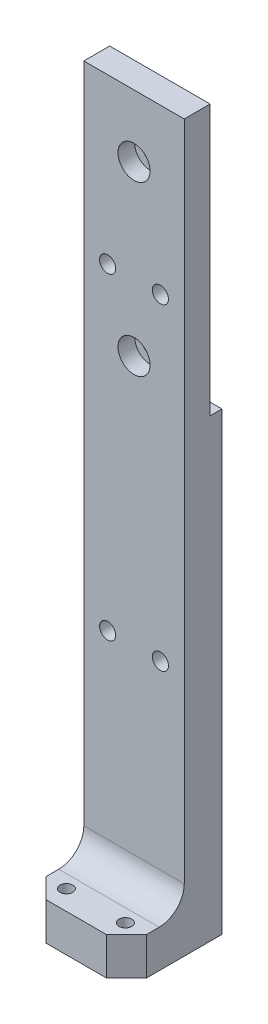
ISO-10303-21;
HEADER;
FILE_DESCRIPTION(('STEP AP214'),'2;1');
FILE_NAME('part.step','',(''),(''),'','','');
FILE_SCHEMA(('AUTOMOTIVE_DESIGN { 1 0 10303 214 1 1 1 1 }'));
ENDSEC;
DATA;
#1=APPLICATION_CONTEXT('core data for automotive mechanical design processes');
#2=APPLICATION_PROTOCOL_DEFINITION('international standard','automotive_design',2000,#1);
#3=PRODUCT_CONTEXT('',#1,'mechanical');
#4=PRODUCT('Part','Part','',(#3));
#5=PRODUCT_RELATED_PRODUCT_CATEGORY('part','',(#4));
#6=PRODUCT_DEFINITION_FORMATION('','',#4);
#7=PRODUCT_DEFINITION_CONTEXT('part definition',#1,'design');
#8=PRODUCT_DEFINITION('design','',#6,#7);
#9=PRODUCT_DEFINITION_SHAPE('','',#8);
#10=(LENGTH_UNIT() NAMED_UNIT(*) SI_UNIT(.MILLI.,.METRE.));
#11=(NAMED_UNIT(*) PLANE_ANGLE_UNIT() SI_UNIT($,.RADIAN.));
#12=(NAMED_UNIT(*) SI_UNIT($,.STERADIAN.) SOLID_ANGLE_UNIT());
#13=UNCERTAINTY_MEASURE_WITH_UNIT(LENGTH_MEASURE(1.E-05),#10,'distance_accuracy_value','');
#14=(GEOMETRIC_REPRESENTATION_CONTEXT(3) GLOBAL_UNCERTAINTY_ASSIGNED_CONTEXT((#13)) GLOBAL_UNIT_ASSIGNED_CONTEXT((#10,
#11,#12)) REPRESENTATION_CONTEXT('',''));
#15=CARTESIAN_POINT('',(0.,0.,0.));
#16=DIRECTION('',(0.,0.,1.));
#17=DIRECTION('',(1.,0.,0.));
#18=AXIS2_PLACEMENT_3D('',#15,#16,#17);
#19=CARTESIAN_POINT('',(-10.16,0.,15.24));
#20=DIRECTION('',(1.,0.,0.));
#21=DIRECTION('',(0.,1.,0.));
#22=AXIS2_PLACEMENT_3D('',#19,#20,#21);
#23=PLANE('',#22);
#24=CARTESIAN_POINT('',(-10.16,-30.861,11.43));
#25=DIRECTION('',(-1.,0.,0.));
#26=DIRECTION('',(0.,0.,1.));
#27=AXIS2_PLACEMENT_3D('',#24,#25,#26);
#28=CIRCLE('',#27,1.25);
#29=CARTESIAN_POINT('',(-10.16,-30.861,12.68));
#30=VERTEX_POINT('',#29);
#31=EDGE_CURVE('E151',#30,#30,#28,.T.);
#32=ORIENTED_EDGE('',*,*,#31,.F.);
#33=EDGE_LOOP('',(#32));
#34=FACE_BOUND('',#33,.T.);
#35=DIRECTION('',(0.,0.,1.));
#36=VECTOR('',#35,1.);
#37=CARTESIAN_POINT('',(-10.16,52.324,15.24));
#38=LINE('',#37,#36);
#39=CARTESIAN_POINT('',(-10.16,52.324,10.0076));
#40=VERTEX_POINT('',#39);
#41=CARTESIAN_POINT('',(-10.16,52.324,15.24));
#42=VERTEX_POINT('',#41);
#43=EDGE_CURVE('E240',#40,#42,#38,.T.);
#44=ORIENTED_EDGE('',*,*,#43,.F.);
#45=DIRECTION('',(0.,1.,0.));
#46=VECTOR('',#45,1.);
#47=CARTESIAN_POINT('',(-10.16,52.324,10.0076));
#48=LINE('',#47,#46);
#49=CARTESIAN_POINT('',(-10.16,-2.286,10.0076));
#50=VERTEX_POINT('',#49);
#51=EDGE_CURVE('E53',#50,#40,#48,.T.);
#52=ORIENTED_EDGE('',*,*,#51,.F.);
#53=DIRECTION('',(0.,0.,1.));
#54=VECTOR('',#53,1.);
#55=CARTESIAN_POINT('',(-10.16,-2.286,7.62000000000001));
#56=LINE('',#55,#54);
#57=CARTESIAN_POINT('',(-10.16,-2.286,7.62000000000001));
#58=VERTEX_POINT('',#57);
#59=EDGE_CURVE('E191',#58,#50,#56,.T.);
#60=ORIENTED_EDGE('',*,*,#59,.F.);
#61=DIRECTION('',(0.,1.,0.));
#62=VECTOR('',#61,1.);
#63=CARTESIAN_POINT('',(-10.16,-94.361,7.62));
#64=LINE('',#63,#62);
#65=CARTESIAN_POINT('',(-10.16,-81.661,7.62000000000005));
#66=VERTEX_POINT('',#65);
#67=EDGE_CURVE('E275',#66,#58,#64,.T.);
#68=ORIENTED_EDGE('',*,*,#67,.F.);
#69=DIRECTION('',(0.,0.,-1.));
#70=VECTOR('',#69,1.);
#71=CARTESIAN_POINT('',(-10.16,-81.661,7.62000000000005));
#72=LINE('',#71,#70);
#73=CARTESIAN_POINT('',(-10.16,-81.661,11.6840000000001));
#74=VERTEX_POINT('',#73);
#75=EDGE_CURVE('E207',#74,#66,#72,.T.);
#76=ORIENTED_EDGE('',*,*,#75,.F.);
#77=DIRECTION('',(0.,-1.,0.));
#78=VECTOR('',#77,1.);
#79=CARTESIAN_POINT('',(-10.16,-81.661,11.6840000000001));
#80=LINE('',#79,#78);
#81=CARTESIAN_POINT('',(-10.16,-94.361,11.6840000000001));
#82=VERTEX_POINT('',#81);
#83=EDGE_CURVE('E216',#74,#82,#80,.T.);
#84=ORIENTED_EDGE('',*,*,#83,.T.);
#85=DIRECTION('',(0.,0.,-1.));
#86=VECTOR('',#85,1.);
#87=CARTESIAN_POINT('',(-10.16,-94.361,15.24));
#88=LINE('',#87,#86);
#89=CARTESIAN_POINT('',(-10.16,-94.361,22.871303));
#90=VERTEX_POINT('',#89);
#91=EDGE_CURVE('E255',#90,#82,#88,.T.);
#92=ORIENTED_EDGE('',*,*,#91,.F.);
#93=DIRECTION('',(0.,1.,0.));
#94=VECTOR('',#93,1.);
#95=CARTESIAN_POINT('',(-10.16,-86.741,22.871303));
#96=LINE('',#95,#94);
#97=CARTESIAN_POINT('',(-10.16,-86.741,22.871303));
#98=VERTEX_POINT('',#97);
#99=EDGE_CURVE('E11',#90,#98,#96,.T.);
#100=ORIENTED_EDGE('',*,*,#99,.T.);
#101=DIRECTION('',(0.,0.,-1.));
#102=VECTOR('',#101,1.);
#103=CARTESIAN_POINT('',(-10.16,-86.741,26.935303));
#104=LINE('',#103,#102);
#105=CARTESIAN_POINT('',(-10.16,-86.741,20.32));
#106=VERTEX_POINT('',#105);
#107=EDGE_CURVE('E254',#98,#106,#104,.T.);
#108=ORIENTED_EDGE('',*,*,#107,.T.);
#109=CARTESIAN_POINT('',(-10.16,-81.661,20.32));
#110=DIRECTION('',(1.,0.,0.));
#111=DIRECTION('',(0.,1.,0.));
#112=AXIS2_PLACEMENT_3D('',#109,#110,#111);
#113=CIRCLE('',#112,5.08);
#114=CARTESIAN_POINT('',(-10.16,-81.661,15.24));
#115=VERTEX_POINT('',#114);
#116=EDGE_CURVE('E410',#106,#115,#113,.T.);
#117=ORIENTED_EDGE('',*,*,#116,.T.);
#118=DIRECTION('',(0.,-1.,0.));
#119=VECTOR('',#118,1.);
#120=CARTESIAN_POINT('',(-10.16,0.,15.24));
#121=LINE('',#120,#119);
#122=EDGE_CURVE('E270',#42,#115,#121,.T.);
#123=ORIENTED_EDGE('',*,*,#122,.F.);
#124=EDGE_LOOP('',(#44,#52,#60,#68,#76,#84,#92,#100,#108,#117,#123));
#125=FACE_BOUND('',#124,.T.);
#126=ADVANCED_FACE('F36',(#34,#125),#23,.F.);
#127=CARTESIAN_POINT('',(10.16,0.,15.24));
#128=DIRECTION('',(-1.,0.,0.));
#129=DIRECTION('',(0.,-1.,0.));
#130=AXIS2_PLACEMENT_3D('',#127,#128,#129);
#131=PLANE('',#130);
#132=DIRECTION('',(0.,0.,1.));
#133=VECTOR('',#132,1.);
#134=CARTESIAN_POINT('',(10.16,-2.28599999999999,7.62000000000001));
#135=LINE('',#134,#133);
#136=CARTESIAN_POINT('',(10.16,-2.28599999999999,7.62000000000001));
#137=VERTEX_POINT('',#136);
#138=CARTESIAN_POINT('',(10.16,-2.28599999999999,10.0076));
#139=VERTEX_POINT('',#138);
#140=EDGE_CURVE('E184',#137,#139,#135,.T.);
#141=ORIENTED_EDGE('',*,*,#140,.T.);
#142=DIRECTION('',(0.,1.,0.));
#143=VECTOR('',#142,1.);
#144=CARTESIAN_POINT('',(10.16,52.324,10.0076));
#145=LINE('',#144,#143);
#146=CARTESIAN_POINT('',(10.16,52.324,10.0076));
#147=VERTEX_POINT('',#146);
#148=EDGE_CURVE('E187',#139,#147,#145,.T.);
#149=ORIENTED_EDGE('',*,*,#148,.T.);
#150=DIRECTION('',(0.,0.,-1.));
#151=VECTOR('',#150,1.);
#152=CARTESIAN_POINT('',(10.16,52.324,15.24));
#153=LINE('',#152,#151);
#154=CARTESIAN_POINT('',(10.16,52.324,15.24));
#155=VERTEX_POINT('',#154);
#156=EDGE_CURVE('E245',#155,#147,#153,.T.);
#157=ORIENTED_EDGE('',*,*,#156,.F.);
#158=DIRECTION('',(0.,1.,0.));
#159=VECTOR('',#158,1.);
#160=CARTESIAN_POINT('',(10.16,0.,15.24));
#161=LINE('',#160,#159);
#162=CARTESIAN_POINT('',(10.16,-81.661,15.24));
#163=VERTEX_POINT('',#162);
#164=EDGE_CURVE('E274',#163,#155,#161,.T.);
#165=ORIENTED_EDGE('',*,*,#164,.F.);
#166=CARTESIAN_POINT('',(10.16,-81.661,20.32));
#167=DIRECTION('',(-1.,0.,0.));
#168=DIRECTION('',(0.,-1.,0.));
#169=AXIS2_PLACEMENT_3D('',#166,#167,#168);
#170=CIRCLE('',#169,5.08);
#171=CARTESIAN_POINT('',(10.16,-86.741,20.32));
#172=VERTEX_POINT('',#171);
#173=EDGE_CURVE('E407',#163,#172,#170,.T.);
#174=ORIENTED_EDGE('',*,*,#173,.T.);
#175=DIRECTION('',(0.,0.,-1.));
#176=VECTOR('',#175,1.);
#177=CARTESIAN_POINT('',(10.16,-86.741,26.935303));
#178=LINE('',#177,#176);
#179=CARTESIAN_POINT('',(10.16,-86.741,22.871303));
#180=VERTEX_POINT('',#179);
#181=EDGE_CURVE('E259',#180,#172,#178,.T.);
#182=ORIENTED_EDGE('',*,*,#181,.F.);
#183=DIRECTION('',(0.,-1.,0.));
#184=VECTOR('',#183,1.);
#185=CARTESIAN_POINT('',(10.16,-94.361,22.871303));
#186=LINE('',#185,#184);
#187=CARTESIAN_POINT('',(10.16,-94.361,22.871303));
#188=VERTEX_POINT('',#187);
#189=EDGE_CURVE('E291',#180,#188,#186,.T.);
#190=ORIENTED_EDGE('',*,*,#189,.T.);
#191=DIRECTION('',(0.,0.,1.));
#192=VECTOR('',#191,1.);
#193=CARTESIAN_POINT('',(10.16,-94.361,15.24));
#194=LINE('',#193,#192);
#195=CARTESIAN_POINT('',(10.16,-94.361,7.62));
#196=VERTEX_POINT('',#195);
#197=EDGE_CURVE('E261',#196,#188,#194,.T.);
#198=ORIENTED_EDGE('',*,*,#197,.F.);
#199=DIRECTION('',(0.,1.,0.));
#200=VECTOR('',#199,1.);
#201=CARTESIAN_POINT('',(10.16,-94.361,7.62));
#202=LINE('',#201,#200);
#203=EDGE_CURVE('E264',#196,#137,#202,.T.);
#204=ORIENTED_EDGE('',*,*,#203,.T.);
#205=EDGE_LOOP('',(#141,#149,#157,#165,#174,#182,#190,#198,#204));
#206=FACE_BOUND('',#205,.T.);
#207=ADVANCED_FACE('F360',(#206),#131,.F.);
#208=CARTESIAN_POINT('',(-10.16,0.,15.24));
#209=DIRECTION('',(0.,0.,1.));
#210=DIRECTION('',(1.,0.,0.));
#211=AXIS2_PLACEMENT_3D('',#208,#209,#210);
#212=PLANE('',#211);
#213=CARTESIAN_POINT('',(5.33399999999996,19.1518927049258,15.24));
#214=DIRECTION('',(0.,0.,1.));
#215=DIRECTION('',(1.,0.,0.));
#216=AXIS2_PLACEMENT_3D('',#213,#214,#215);
#217=CIRCLE('',#216,1.63195);
#218=CARTESIAN_POINT('',(6.96594999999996,19.1518927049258,15.24));
#219=VERTEX_POINT('',#218);
#220=EDGE_CURVE('E40',#219,#219,#217,.T.);
#221=ORIENTED_EDGE('',*,*,#220,.F.);
#222=EDGE_LOOP('',(#221));
#223=FACE_BOUND('',#222,.T.);
#224=CARTESIAN_POINT('',(5.334,-45.085,15.24));
#225=DIRECTION('',(0.,0.,1.));
#226=DIRECTION('',(1.,0.,0.));
#227=AXIS2_PLACEMENT_3D('',#224,#225,#226);
#228=CIRCLE('',#227,1.63195);
#229=CARTESIAN_POINT('',(6.96595,-45.085,15.24));
#230=VERTEX_POINT('',#229);
#231=EDGE_CURVE('E157',#230,#230,#228,.T.);
#232=ORIENTED_EDGE('',*,*,#231,.F.);
#233=EDGE_LOOP('',(#232));
#234=FACE_BOUND('',#233,.T.);
#235=CARTESIAN_POINT('',(0.,5.715,15.24));
#236=DIRECTION('',(0.,0.,1.));
#237=DIRECTION('',(1.,0.,0.));
#238=AXIS2_PLACEMENT_3D('',#235,#236,#237);
#239=CIRCLE('',#238,3.25);
#240=CARTESIAN_POINT('',(3.24999999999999,5.715,15.24));
#241=VERTEX_POINT('',#240);
#242=EDGE_CURVE('E163',#241,#241,#239,.T.);
#243=ORIENTED_EDGE('',*,*,#242,.F.);
#244=EDGE_LOOP('',(#243));
#245=FACE_BOUND('',#244,.T.);
#246=CARTESIAN_POINT('',(0.,39.7256,15.24));
#247=DIRECTION('',(0.,0.,1.));
#248=DIRECTION('',(1.,0.,0.));
#249=AXIS2_PLACEMENT_3D('',#246,#247,#248);
#250=CIRCLE('',#249,3.25);
#251=CARTESIAN_POINT('',(3.24999999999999,39.7256,15.24));
#252=VERTEX_POINT('',#251);
#253=EDGE_CURVE('E173',#252,#252,#250,.T.);
#254=ORIENTED_EDGE('',*,*,#253,.F.);
#255=EDGE_LOOP('',(#254));
#256=FACE_BOUND('',#255,.T.);
#257=CARTESIAN_POINT('',(-5.33399999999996,19.1518927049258,15.24));
#258=DIRECTION('',(0.,0.,1.));
#259=DIRECTION('',(1.,0.,0.));
#260=AXIS2_PLACEMENT_3D('',#257,#258,#259);
#261=CIRCLE('',#260,1.63195);
#262=CARTESIAN_POINT('',(-3.70204999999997,19.1518927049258,15.24));
#263=VERTEX_POINT('',#262);
#264=EDGE_CURVE('E183',#263,#263,#261,.T.);
#265=ORIENTED_EDGE('',*,*,#264,.F.);
#266=EDGE_LOOP('',(#265));
#267=FACE_BOUND('',#266,.T.);
#268=CARTESIAN_POINT('',(-5.334,-45.085,15.24));
#269=DIRECTION('',(0.,0.,1.));
#270=DIRECTION('',(1.,0.,0.));
#271=AXIS2_PLACEMENT_3D('',#268,#269,#270);
#272=CIRCLE('',#271,1.63195);
#273=CARTESIAN_POINT('',(-3.70205000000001,-45.085,15.24));
#274=VERTEX_POINT('',#273);
#275=EDGE_CURVE('E206',#274,#274,#272,.T.);
#276=ORIENTED_EDGE('',*,*,#275,.F.);
#277=EDGE_LOOP('',(#276));
#278=FACE_BOUND('',#277,.T.);
#279=ORIENTED_EDGE('',*,*,#122,.T.);
#280=DIRECTION('',(-1.,0.,0.));
#281=VECTOR('',#280,1.);
#282=CARTESIAN_POINT('',(-10.16,-81.661,15.24));
#283=LINE('',#282,#281);
#284=EDGE_CURVE('E418',#115,#163,#283,.F.);
#285=ORIENTED_EDGE('',*,*,#284,.T.);
#286=ORIENTED_EDGE('',*,*,#164,.T.);
#287=DIRECTION('',(1.,0.,0.));
#288=VECTOR('',#287,1.);
#289=CARTESIAN_POINT('',(-10.16,52.324,15.24));
#290=LINE('',#289,#288);
#291=EDGE_CURVE('E242',#42,#155,#290,.T.);
#292=ORIENTED_EDGE('',*,*,#291,.F.);
#293=EDGE_LOOP('',(#279,#285,#286,#292));
#294=FACE_BOUND('',#293,.T.);
#295=ADVANCED_FACE('F366',(#223,#234,#245,#256,#267,#278,#294),#212,.T.);
#296=CARTESIAN_POINT('',(-10.16,-94.361,7.62));
#297=DIRECTION('',(0.,0.,1.));
#298=DIRECTION('',(1.,0.,0.));
#299=AXIS2_PLACEMENT_3D('',#296,#297,#298);
#300=PLANE('',#299);
#301=CARTESIAN_POINT('',(5.334,-45.085,7.62));
#302=DIRECTION('',(0.,0.,-1.));
#303=DIRECTION('',(-1.,0.,0.));
#304=AXIS2_PLACEMENT_3D('',#301,#302,#303);
#305=CIRCLE('',#304,3.1887033);
#306=CARTESIAN_POINT('',(2.14529670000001,-45.085,7.62));
#307=VERTEX_POINT('',#306);
#308=EDGE_CURVE('E306',#307,#307,#305,.T.);
#309=ORIENTED_EDGE('',*,*,#308,.F.);
#310=EDGE_LOOP('',(#309));
#311=FACE_BOUND('',#310,.T.);
#312=CARTESIAN_POINT('',(-5.334,-45.085,7.62));
#313=DIRECTION('',(0.,0.,-1.));
#314=DIRECTION('',(-1.,0.,0.));
#315=AXIS2_PLACEMENT_3D('',#312,#313,#314);
#316=CIRCLE('',#315,3.1887033);
#317=CARTESIAN_POINT('',(-8.52270330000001,-45.085,7.62));
#318=VERTEX_POINT('',#317);
#319=EDGE_CURVE('E203',#318,#318,#316,.T.);
#320=ORIENTED_EDGE('',*,*,#319,.F.);
#321=EDGE_LOOP('',(#320));
#322=FACE_BOUND('',#321,.T.);
#323=ORIENTED_EDGE('',*,*,#67,.T.);
#324=DIRECTION('',(-1.,0.,0.));
#325=VECTOR('',#324,1.);
#326=CARTESIAN_POINT('',(10.16,-2.28599999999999,7.62000000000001));
#327=LINE('',#326,#325);
#328=EDGE_CURVE('E190',#137,#58,#327,.T.);
#329=ORIENTED_EDGE('',*,*,#328,.F.);
#330=ORIENTED_EDGE('',*,*,#203,.F.);
#331=DIRECTION('',(1.,0.,0.));
#332=VECTOR('',#331,1.);
#333=CARTESIAN_POINT('',(-10.16,-94.361,7.62));
#334=LINE('',#333,#332);
#335=CARTESIAN_POINT('',(-6.096,-94.361,7.62));
#336=VERTEX_POINT('',#335);
#337=EDGE_CURVE('E258',#336,#196,#334,.T.);
#338=ORIENTED_EDGE('',*,*,#337,.F.);
#339=DIRECTION('',(0.,-1.,0.));
#340=VECTOR('',#339,1.);
#341=CARTESIAN_POINT('',(-6.096,-81.661,7.62000000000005));
#342=LINE('',#341,#340);
#343=CARTESIAN_POINT('',(-6.096,-81.661,7.62000000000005));
#344=VERTEX_POINT('',#343);
#345=EDGE_CURVE('E61',#344,#336,#342,.T.);
#346=ORIENTED_EDGE('',*,*,#345,.F.);
#347=DIRECTION('',(1.,0.,0.));
#348=VECTOR('',#347,1.);
#349=CARTESIAN_POINT('',(-10.16,-81.661,7.62000000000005));
#350=LINE('',#349,#348);
#351=EDGE_CURVE('E209',#66,#344,#350,.T.);
#352=ORIENTED_EDGE('',*,*,#351,.F.);
#353=EDGE_LOOP('',(#323,#329,#330,#338,#346,#352));
#354=FACE_BOUND('',#353,.T.);
#355=ADVANCED_FACE('F445',(#311,#322,#354),#300,.F.);
#356=CARTESIAN_POINT('',(-10.16,-94.361,7.62));
#357=DIRECTION('',(0.,-1.,0.));
#358=DIRECTION('',(0.,0.,-1.));
#359=AXIS2_PLACEMENT_3D('',#356,#357,#358);
#360=PLANE('',#359);
#361=DIRECTION('',(-0.707106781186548,0.,0.707106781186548));
#362=VECTOR('',#361,1.);
#363=CARTESIAN_POINT('',(-10.16,-94.361,11.6840000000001));
#364=LINE('',#363,#362);
#365=EDGE_CURVE('E210',#336,#82,#364,.T.);
#366=ORIENTED_EDGE('',*,*,#365,.F.);
#367=ORIENTED_EDGE('',*,*,#337,.T.);
#368=ORIENTED_EDGE('',*,*,#197,.T.);
#369=DIRECTION('',(-0.707106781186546,0.,0.707106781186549));
#370=VECTOR('',#369,1.);
#371=CARTESIAN_POINT('',(7.62565150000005,-94.361,25.4056515));
#372=LINE('',#371,#370);
#373=CARTESIAN_POINT('',(6.09600000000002,-94.361,26.935303));
#374=VERTEX_POINT('',#373);
#375=EDGE_CURVE('E45',#188,#374,#372,.T.);
#376=ORIENTED_EDGE('',*,*,#375,.T.);
#377=DIRECTION('',(1.,0.,0.));
#378=VECTOR('',#377,1.);
#379=CARTESIAN_POINT('',(10.16,-94.361,26.935303));
#380=LINE('',#379,#378);
#381=CARTESIAN_POINT('',(-6.096,-94.361,26.935303));
#382=VERTEX_POINT('',#381);
#383=EDGE_CURVE('E251',#382,#374,#380,.T.);
#384=ORIENTED_EDGE('',*,*,#383,.F.);
#385=DIRECTION('',(-0.707106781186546,0.,-0.707106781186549));
#386=VECTOR('',#385,1.);
#387=CARTESIAN_POINT('',(-17.7856515,-94.361,15.2456515));
#388=LINE('',#387,#386);
#389=EDGE_CURVE('E293',#382,#90,#388,.T.);
#390=ORIENTED_EDGE('',*,*,#389,.T.);
#391=ORIENTED_EDGE('',*,*,#91,.T.);
#392=EDGE_LOOP('',(#366,#367,#368,#376,#384,#390,#391));
#393=FACE_BOUND('',#392,.T.);
#394=CARTESIAN_POINT('',(5.96899999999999,-94.361,11.60378124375));
#395=DIRECTION('',(0.,-1.,0.));
#396=DIRECTION('',(0.,0.,-1.));
#397=AXIS2_PLACEMENT_3D('',#394,#395,#396);
#398=CIRCLE('',#397,1.28905);
#399=CARTESIAN_POINT('',(5.96899999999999,-94.361,10.31473124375));
#400=VERTEX_POINT('',#399);
#401=EDGE_CURVE('E223',#400,#400,#398,.T.);
#402=ORIENTED_EDGE('',*,*,#401,.F.);
#403=EDGE_LOOP('',(#402));
#404=FACE_BOUND('',#403,.T.);
#405=CARTESIAN_POINT('',(-5.96899999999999,-94.361,11.60378124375));
#406=DIRECTION('',(0.,-1.,0.));
#407=DIRECTION('',(0.,0.,-1.));
#408=AXIS2_PLACEMENT_3D('',#405,#406,#407);
#409=CIRCLE('',#408,1.28905);
#410=CARTESIAN_POINT('',(-5.96899999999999,-94.361,10.31473124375));
#411=VERTEX_POINT('',#410);
#412=EDGE_CURVE('E229',#411,#411,#409,.T.);
#413=ORIENTED_EDGE('',*,*,#412,.F.);
#414=EDGE_LOOP('',(#413));
#415=FACE_BOUND('',#414,.T.);
#416=CARTESIAN_POINT('',(-5.96899999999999,-94.361,22.95152175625));
#417=DIRECTION('',(0.,-1.,0.));
#418=DIRECTION('',(0.,0.,-1.));
#419=AXIS2_PLACEMENT_3D('',#416,#417,#418);
#420=CIRCLE('',#419,1.28905);
#421=CARTESIAN_POINT('',(-5.96899999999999,-94.361,21.66247175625));
#422=VERTEX_POINT('',#421);
#423=EDGE_CURVE('E232',#422,#422,#420,.T.);
#424=ORIENTED_EDGE('',*,*,#423,.F.);
#425=EDGE_LOOP('',(#424));
#426=FACE_BOUND('',#425,.T.);
#427=CARTESIAN_POINT('',(5.96899999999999,-94.361,22.95152175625));
#428=DIRECTION('',(0.,-1.,0.));
#429=DIRECTION('',(0.,0.,-1.));
#430=AXIS2_PLACEMENT_3D('',#427,#428,#429);
#431=CIRCLE('',#430,1.28905);
#432=CARTESIAN_POINT('',(5.96899999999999,-94.361,21.66247175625));
#433=VERTEX_POINT('',#432);
#434=EDGE_CURVE('E236',#433,#433,#431,.T.);
#435=ORIENTED_EDGE('',*,*,#434,.F.);
#436=EDGE_LOOP('',(#435));
#437=FACE_BOUND('',#436,.T.);
#438=ADVANCED_FACE('F397',(#393,#404,#415,#426,#437),#360,.T.);
#439=CARTESIAN_POINT('',(10.16,-86.741,26.935303));
#440=DIRECTION('',(0.,-1.,0.));
#441=DIRECTION('',(0.,0.,-1.));
#442=AXIS2_PLACEMENT_3D('',#439,#440,#441);
#443=PLANE('',#442);
#444=CARTESIAN_POINT('',(-5.96899999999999,-86.741,22.95152175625));
#445=DIRECTION('',(0.,-1.,0.));
#446=DIRECTION('',(0.,0.,-1.));
#447=AXIS2_PLACEMENT_3D('',#444,#445,#446);
#448=CIRCLE('',#447,1.28905);
#449=CARTESIAN_POINT('',(-5.96899999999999,-86.741,21.66247175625));
#450=VERTEX_POINT('',#449);
#451=EDGE_CURVE('E235',#450,#450,#448,.T.);
#452=ORIENTED_EDGE('',*,*,#451,.T.);
#453=EDGE_LOOP('',(#452));
#454=FACE_BOUND('',#453,.T.);
#455=CARTESIAN_POINT('',(5.96899999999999,-86.741,22.95152175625));
#456=DIRECTION('',(0.,-1.,0.));
#457=DIRECTION('',(0.,0.,-1.));
#458=AXIS2_PLACEMENT_3D('',#455,#456,#457);
#459=CIRCLE('',#458,1.28905);
#460=CARTESIAN_POINT('',(5.96899999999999,-86.741,21.66247175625));
#461=VERTEX_POINT('',#460);
#462=EDGE_CURVE('E239',#461,#461,#459,.T.);
#463=ORIENTED_EDGE('',*,*,#462,.T.);
#464=EDGE_LOOP('',(#463));
#465=FACE_BOUND('',#464,.T.);
#466=DIRECTION('',(-1.,0.,0.));
#467=VECTOR('',#466,1.);
#468=CARTESIAN_POINT('',(10.16,-86.741,26.935303));
#469=LINE('',#468,#467);
#470=CARTESIAN_POINT('',(6.09600000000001,-86.741,26.935303));
#471=VERTEX_POINT('',#470);
#472=CARTESIAN_POINT('',(-6.096,-86.741,26.935303));
#473=VERTEX_POINT('',#472);
#474=EDGE_CURVE('E248',#471,#473,#469,.T.);
#475=ORIENTED_EDGE('',*,*,#474,.F.);
#476=DIRECTION('',(0.707106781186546,0.,-0.707106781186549));
#477=VECTOR('',#476,1.);
#478=CARTESIAN_POINT('',(6.09600000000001,-86.741,26.935303));
#479=LINE('',#478,#477);
#480=EDGE_CURVE('E288',#471,#180,#479,.T.);
#481=ORIENTED_EDGE('',*,*,#480,.T.);
#482=ORIENTED_EDGE('',*,*,#181,.T.);
#483=DIRECTION('',(-1.,0.,0.));
#484=VECTOR('',#483,1.);
#485=CARTESIAN_POINT('',(10.16,-86.741,20.32));
#486=LINE('',#485,#484);
#487=EDGE_CURVE('E420',#172,#106,#486,.T.);
#488=ORIENTED_EDGE('',*,*,#487,.T.);
#489=ORIENTED_EDGE('',*,*,#107,.F.);
#490=DIRECTION('',(0.707106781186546,0.,0.707106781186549));
#491=VECTOR('',#490,1.);
#492=CARTESIAN_POINT('',(-6.096,-86.741,26.935303));
#493=LINE('',#492,#491);
#494=EDGE_CURVE('E286',#98,#473,#493,.T.);
#495=ORIENTED_EDGE('',*,*,#494,.T.);
#496=EDGE_LOOP('',(#475,#481,#482,#488,#489,#495));
#497=FACE_BOUND('',#496,.T.);
#498=ADVANCED_FACE('F425',(#454,#465,#497),#443,.F.);
#499=CARTESIAN_POINT('',(10.16,-86.741,26.935303));
#500=DIRECTION('',(0.,0.,1.));
#501=DIRECTION('',(1.,0.,0.));
#502=AXIS2_PLACEMENT_3D('',#499,#500,#501);
#503=PLANE('',#502);
#504=ORIENTED_EDGE('',*,*,#383,.T.);
#505=DIRECTION('',(0.,1.,0.));
#506=VECTOR('',#505,1.);
#507=CARTESIAN_POINT('',(6.09600000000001,-86.741,26.935303));
#508=LINE('',#507,#506);
#509=EDGE_CURVE('E289',#374,#471,#508,.T.);
#510=ORIENTED_EDGE('',*,*,#509,.T.);
#511=ORIENTED_EDGE('',*,*,#474,.T.);
#512=DIRECTION('',(0.,-1.,0.));
#513=VECTOR('',#512,1.);
#514=CARTESIAN_POINT('',(-6.096,-94.361,26.935303));
#515=LINE('',#514,#513);
#516=EDGE_CURVE('E405',#473,#382,#515,.T.);
#517=ORIENTED_EDGE('',*,*,#516,.T.);
#518=EDGE_LOOP('',(#504,#510,#511,#517));
#519=FACE_BOUND('',#518,.T.);
#520=ADVANCED_FACE('F402',(#519),#503,.T.);
#521=CARTESIAN_POINT('',(-10.16,52.324,0.));
#522=DIRECTION('',(0.,-1.,0.));
#523=DIRECTION('',(1.,0.,0.));
#524=AXIS2_PLACEMENT_3D('',#521,#522,#523);
#525=PLANE('',#524);
#526=ORIENTED_EDGE('',*,*,#156,.T.);
#527=DIRECTION('',(-1.,0.,0.));
#528=VECTOR('',#527,1.);
#529=CARTESIAN_POINT('',(10.16,52.324,10.0076));
#530=LINE('',#529,#528);
#531=EDGE_CURVE('E195',#147,#40,#530,.T.);
#532=ORIENTED_EDGE('',*,*,#531,.T.);
#533=ORIENTED_EDGE('',*,*,#43,.T.);
#534=ORIENTED_EDGE('',*,*,#291,.T.);
#535=EDGE_LOOP('',(#526,#532,#533,#534));
#536=FACE_BOUND('',#535,.T.);
#537=ADVANCED_FACE('F376',(#536),#525,.F.);
#538=CARTESIAN_POINT('',(10.16,-81.661,20.32));
#539=DIRECTION('',(-1.,0.,0.));
#540=DIRECTION('',(0.,0.,1.));
#541=AXIS2_PLACEMENT_3D('',#538,#539,#540);
#542=CYLINDRICAL_SURFACE('',#541,5.08);
#543=ORIENTED_EDGE('',*,*,#173,.F.);
#544=ORIENTED_EDGE('',*,*,#284,.F.);
#545=ORIENTED_EDGE('',*,*,#116,.F.);
#546=ORIENTED_EDGE('',*,*,#487,.F.);
#547=EDGE_LOOP('',(#543,#544,#545,#546));
#548=FACE_BOUND('',#547,.T.);
#549=ADVANCED_FACE('F373',(#548),#542,.F.);
#550=CARTESIAN_POINT('',(5.96899999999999,-94.361,22.95152175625));
#551=DIRECTION('',(0.,-1.,0.));
#552=DIRECTION('',(0.,0.,-1.));
#553=AXIS2_PLACEMENT_3D('',#550,#551,#552);
#554=CYLINDRICAL_SURFACE('',#553,1.28905);
#555=ORIENTED_EDGE('',*,*,#434,.T.);
#556=EDGE_LOOP('',(#555));
#557=FACE_BOUND('',#556,.T.);
#558=ORIENTED_EDGE('',*,*,#462,.F.);
#559=EDGE_LOOP('',(#558));
#560=FACE_BOUND('',#559,.T.);
#561=ADVANCED_FACE('F375',(#557,#560),#554,.F.);
#562=CARTESIAN_POINT('',(-5.96899999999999,-94.361,22.95152175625));
#563=DIRECTION('',(0.,-1.,0.));
#564=DIRECTION('',(0.,0.,-1.));
#565=AXIS2_PLACEMENT_3D('',#562,#563,#564);
#566=CYLINDRICAL_SURFACE('',#565,1.28905);
#567=ORIENTED_EDGE('',*,*,#423,.T.);
#568=EDGE_LOOP('',(#567));
#569=FACE_BOUND('',#568,.T.);
#570=ORIENTED_EDGE('',*,*,#451,.F.);
#571=EDGE_LOOP('',(#570));
#572=FACE_BOUND('',#571,.T.);
#573=ADVANCED_FACE('F472',(#569,#572),#566,.F.);
#574=CARTESIAN_POINT('',(-5.96899999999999,-94.361,11.60378124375));
#575=DIRECTION('',(0.,-1.,0.));
#576=DIRECTION('',(0.,0.,-1.));
#577=AXIS2_PLACEMENT_3D('',#574,#575,#576);
#578=CYLINDRICAL_SURFACE('',#577,1.28905);
#579=CARTESIAN_POINT('',(-5.96899999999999,-86.106,11.60378124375));
#580=DIRECTION('',(0.,-1.,0.));
#581=DIRECTION('',(0.,0.,-1.));
#582=AXIS2_PLACEMENT_3D('',#579,#580,#581);
#583=CIRCLE('',#582,1.28905);
#584=CARTESIAN_POINT('',(-5.96899999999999,-86.106,10.31473124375));
#585=VERTEX_POINT('',#584);
#586=EDGE_CURVE('E226',#585,#585,#583,.T.);
#587=ORIENTED_EDGE('',*,*,#586,.F.);
#588=EDGE_LOOP('',(#587));
#589=FACE_BOUND('',#588,.T.);
#590=ORIENTED_EDGE('',*,*,#412,.T.);
#591=EDGE_LOOP('',(#590));
#592=FACE_BOUND('',#591,.T.);
#593=ADVANCED_FACE('F468',(#589,#592),#578,.F.);
#594=CARTESIAN_POINT('',(-5.96899999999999,-86.106,11.60378124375));
#595=DIRECTION('',(0.,-1.,0.));
#596=DIRECTION('',(0.,0.,-1.));
#597=AXIS2_PLACEMENT_3D('',#594,#595,#596);
#598=CONICAL_SURFACE('',#597,1.28905,1.02974425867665);
#599=CARTESIAN_POINT('',(-5.969,-85.3314606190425,11.60378124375));
#600=VERTEX_POINT('',#599);
#601=VERTEX_LOOP('',#600);
#602=FACE_BOUND('',#601,.T.);
#603=ORIENTED_EDGE('',*,*,#586,.T.);
#604=EDGE_LOOP('',(#603));
#605=FACE_BOUND('',#604,.T.);
#606=ADVANCED_FACE('F464',(#602,#605),#598,.F.);
#607=CARTESIAN_POINT('',(5.96899999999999,-94.361,11.60378124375));
#608=DIRECTION('',(0.,-1.,0.));
#609=DIRECTION('',(0.,0.,-1.));
#610=AXIS2_PLACEMENT_3D('',#607,#608,#609);
#611=CYLINDRICAL_SURFACE('',#610,1.28905);
#612=CARTESIAN_POINT('',(5.96899999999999,-86.106,11.60378124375));
#613=DIRECTION('',(0.,-1.,0.));
#614=DIRECTION('',(0.,0.,-1.));
#615=AXIS2_PLACEMENT_3D('',#612,#613,#614);
#616=CIRCLE('',#615,1.28905);
#617=CARTESIAN_POINT('',(5.96899999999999,-86.106,10.31473124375));
#618=VERTEX_POINT('',#617);
#619=EDGE_CURVE('E219',#618,#618,#616,.T.);
#620=ORIENTED_EDGE('',*,*,#619,.F.);
#621=EDGE_LOOP('',(#620));
#622=FACE_BOUND('',#621,.T.);
#623=ORIENTED_EDGE('',*,*,#401,.T.);
#624=EDGE_LOOP('',(#623));
#625=FACE_BOUND('',#624,.T.);
#626=ADVANCED_FACE('F388',(#622,#625),#611,.F.);
#627=CARTESIAN_POINT('',(5.96899999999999,-86.106,11.60378124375));
#628=DIRECTION('',(0.,-1.,0.));
#629=DIRECTION('',(0.,0.,-1.));
#630=AXIS2_PLACEMENT_3D('',#627,#628,#629);
#631=CONICAL_SURFACE('',#630,1.28905,1.02974425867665);
#632=CARTESIAN_POINT('',(5.96899999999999,-85.3314606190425,11.60378124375));
#633=VERTEX_POINT('',#632);
#634=VERTEX_LOOP('',#633);
#635=FACE_BOUND('',#634,.T.);
#636=ORIENTED_EDGE('',*,*,#619,.T.);
#637=EDGE_LOOP('',(#636));
#638=FACE_BOUND('',#637,.T.);
#639=ADVANCED_FACE('F380',(#635,#638),#631,.F.);
#640=CARTESIAN_POINT('',(6.09600000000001,-86.741,26.935303));
#641=DIRECTION('',(0.707106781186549,0.,0.707106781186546));
#642=DIRECTION('',(0.707106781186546,0.,-0.707106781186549));
#643=AXIS2_PLACEMENT_3D('',#640,#641,#642);
#644=PLANE('',#643);
#645=ORIENTED_EDGE('',*,*,#375,.F.);
#646=ORIENTED_EDGE('',*,*,#189,.F.);
#647=ORIENTED_EDGE('',*,*,#480,.F.);
#648=ORIENTED_EDGE('',*,*,#509,.F.);
#649=EDGE_LOOP('',(#645,#646,#647,#648));
#650=FACE_BOUND('',#649,.T.);
#651=ADVANCED_FACE('F378',(#650),#644,.T.);
#652=CARTESIAN_POINT('',(-6.096,-86.741,26.935303));
#653=DIRECTION('',(-0.707106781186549,0.,0.707106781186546));
#654=DIRECTION('',(0.707106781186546,0.,0.707106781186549));
#655=AXIS2_PLACEMENT_3D('',#652,#653,#654);
#656=PLANE('',#655);
#657=ORIENTED_EDGE('',*,*,#494,.F.);
#658=ORIENTED_EDGE('',*,*,#99,.F.);
#659=ORIENTED_EDGE('',*,*,#389,.F.);
#660=ORIENTED_EDGE('',*,*,#516,.F.);
#661=EDGE_LOOP('',(#657,#658,#659,#660));
#662=FACE_BOUND('',#661,.T.);
#663=ADVANCED_FACE('F38',(#662),#656,.T.);
#664=CARTESIAN_POINT('',(-10.16,-81.661,11.6840000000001));
#665=DIRECTION('',(0.707106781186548,0.,0.707106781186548));
#666=DIRECTION('',(0.707106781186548,0.,-0.707106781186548));
#667=AXIS2_PLACEMENT_3D('',#664,#665,#666);
#668=PLANE('',#667);
#669=ORIENTED_EDGE('',*,*,#365,.T.);
#670=ORIENTED_EDGE('',*,*,#83,.F.);
#671=DIRECTION('',(-0.707106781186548,0.,0.707106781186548));
#672=VECTOR('',#671,1.);
#673=CARTESIAN_POINT('',(-10.16,-81.661,11.6840000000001));
#674=LINE('',#673,#672);
#675=EDGE_CURVE('E212',#344,#74,#674,.T.);
#676=ORIENTED_EDGE('',*,*,#675,.F.);
#677=ORIENTED_EDGE('',*,*,#345,.T.);
#678=EDGE_LOOP('',(#669,#670,#676,#677));
#679=FACE_BOUND('',#678,.T.);
#680=ADVANCED_FACE('F386',(#679),#668,.F.);
#681=CARTESIAN_POINT('',(-10.16,-81.661,7.62000000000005));
#682=DIRECTION('',(0.,1.,0.));
#683=DIRECTION('',(0.,0.,1.));
#684=AXIS2_PLACEMENT_3D('',#681,#682,#683);
#685=PLANE('',#684);
#686=ORIENTED_EDGE('',*,*,#75,.T.);
#687=ORIENTED_EDGE('',*,*,#351,.T.);
#688=ORIENTED_EDGE('',*,*,#675,.T.);
#689=EDGE_LOOP('',(#686,#687,#688));
#690=FACE_BOUND('',#689,.T.);
#691=ADVANCED_FACE('F449',(#690),#685,.F.);
#692=CARTESIAN_POINT('',(-5.334,-45.085,7.62));
#693=DIRECTION('',(0.,0.,-1.));
#694=DIRECTION('',(-1.,0.,0.));
#695=AXIS2_PLACEMENT_3D('',#692,#693,#694);
#696=CONICAL_SURFACE('',#695,3.1887033,0.715584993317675);
#697=CARTESIAN_POINT('',(-5.334,-45.085,9.41083981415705));
#698=DIRECTION('',(0.,0.,-1.));
#699=DIRECTION('',(-1.,0.,0.));
#700=AXIS2_PLACEMENT_3D('',#697,#698,#699);
#701=CIRCLE('',#700,1.63195);
#702=CARTESIAN_POINT('',(-6.96595,-45.085,9.41083981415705));
#703=VERTEX_POINT('',#702);
#704=EDGE_CURVE('E197',#703,#703,#701,.T.);
#705=ORIENTED_EDGE('',*,*,#704,.F.);
#706=EDGE_LOOP('',(#705));
#707=FACE_BOUND('',#706,.T.);
#708=ORIENTED_EDGE('',*,*,#319,.T.);
#709=EDGE_LOOP('',(#708));
#710=FACE_BOUND('',#709,.T.);
#711=ADVANCED_FACE('F458',(#707,#710),#696,.F.);
#712=CARTESIAN_POINT('',(-5.334,-45.085,7.62));
#713=DIRECTION('',(0.,0.,-1.));
#714=DIRECTION('',(-1.,0.,0.));
#715=AXIS2_PLACEMENT_3D('',#712,#713,#714);
#716=CYLINDRICAL_SURFACE('',#715,1.63195);
#717=ORIENTED_EDGE('',*,*,#275,.T.);
#718=EDGE_LOOP('',(#717));
#719=FACE_BOUND('',#718,.T.);
#720=ORIENTED_EDGE('',*,*,#704,.T.);
#721=EDGE_LOOP('',(#720));
#722=FACE_BOUND('',#721,.T.);
#723=ADVANCED_FACE('F336',(#719,#722),#716,.F.);
#724=CARTESIAN_POINT('',(10.16,52.324,10.0076));
#725=DIRECTION('',(0.,0.,1.));
#726=DIRECTION('',(0.,-1.,0.));
#727=AXIS2_PLACEMENT_3D('',#724,#725,#726);
#728=PLANE('',#727);
#729=CARTESIAN_POINT('',(5.33399999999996,19.1518927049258,10.0076));
#730=DIRECTION('',(0.,0.,-1.));
#731=DIRECTION('',(0.,1.,0.));
#732=AXIS2_PLACEMENT_3D('',#729,#730,#731);
#733=CIRCLE('',#732,3.1887033);
#734=CARTESIAN_POINT('',(5.33399999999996,22.3405960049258,10.0076));
#735=VERTEX_POINT('',#734);
#736=EDGE_CURVE('E316',#735,#735,#733,.T.);
#737=ORIENTED_EDGE('',*,*,#736,.F.);
#738=EDGE_LOOP('',(#737));
#739=FACE_BOUND('',#738,.T.);
#740=CARTESIAN_POINT('',(0.,5.715,10.0076));
#741=DIRECTION('',(0.,0.,1.));
#742=DIRECTION('',(0.,-1.,0.));
#743=AXIS2_PLACEMENT_3D('',#740,#741,#742);
#744=CIRCLE('',#743,1.6);
#745=CARTESIAN_POINT('',(0.,4.115,10.0076));
#746=VERTEX_POINT('',#745);
#747=EDGE_CURVE('E166',#746,#746,#744,.T.);
#748=ORIENTED_EDGE('',*,*,#747,.T.);
#749=EDGE_LOOP('',(#748));
#750=FACE_BOUND('',#749,.T.);
#751=CARTESIAN_POINT('',(0.,39.7256,10.0076));
#752=DIRECTION('',(0.,0.,1.));
#753=DIRECTION('',(0.,-1.,0.));
#754=AXIS2_PLACEMENT_3D('',#751,#752,#753);
#755=CIRCLE('',#754,1.6);
#756=CARTESIAN_POINT('',(0.,38.1256,10.0076));
#757=VERTEX_POINT('',#756);
#758=EDGE_CURVE('E176',#757,#757,#755,.T.);
#759=ORIENTED_EDGE('',*,*,#758,.T.);
#760=EDGE_LOOP('',(#759));
#761=FACE_BOUND('',#760,.T.);
#762=CARTESIAN_POINT('',(-5.33399999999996,19.1518927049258,10.0076));
#763=DIRECTION('',(0.,0.,-1.));
#764=DIRECTION('',(0.,1.,0.));
#765=AXIS2_PLACEMENT_3D('',#762,#763,#764);
#766=CIRCLE('',#765,3.1887033);
#767=CARTESIAN_POINT('',(-5.33399999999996,22.3405960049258,10.0076));
#768=VERTEX_POINT('',#767);
#769=EDGE_CURVE('E180',#768,#768,#766,.T.);
#770=ORIENTED_EDGE('',*,*,#769,.F.);
#771=EDGE_LOOP('',(#770));
#772=FACE_BOUND('',#771,.T.);
#773=ORIENTED_EDGE('',*,*,#51,.T.);
#774=ORIENTED_EDGE('',*,*,#531,.F.);
#775=ORIENTED_EDGE('',*,*,#148,.F.);
#776=DIRECTION('',(-1.,0.,0.));
#777=VECTOR('',#776,1.);
#778=CARTESIAN_POINT('',(10.16,-2.28599999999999,10.0076));
#779=LINE('',#778,#777);
#780=EDGE_CURVE('E198',#139,#50,#779,.T.);
#781=ORIENTED_EDGE('',*,*,#780,.T.);
#782=EDGE_LOOP('',(#773,#774,#775,#781));
#783=FACE_BOUND('',#782,.T.);
#784=ADVANCED_FACE('F332',(#739,#750,#761,#772,#783),#728,.F.);
#785=CARTESIAN_POINT('',(10.16,-2.28599999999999,7.62000000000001));
#786=DIRECTION('',(0.,-1.,0.));
#787=DIRECTION('',(1.,0.,0.));
#788=AXIS2_PLACEMENT_3D('',#785,#786,#787);
#789=PLANE('',#788);
#790=ORIENTED_EDGE('',*,*,#59,.T.);
#791=ORIENTED_EDGE('',*,*,#780,.F.);
#792=ORIENTED_EDGE('',*,*,#140,.F.);
#793=ORIENTED_EDGE('',*,*,#328,.T.);
#794=EDGE_LOOP('',(#790,#791,#792,#793));
#795=FACE_BOUND('',#794,.T.);
#796=ADVANCED_FACE('F335',(#795),#789,.F.);
#797=CARTESIAN_POINT('',(-5.33399999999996,19.1518927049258,10.0076));
#798=DIRECTION('',(0.,0.,-1.));
#799=DIRECTION('',(0.,1.,0.));
#800=AXIS2_PLACEMENT_3D('',#797,#798,#799);
#801=CONICAL_SURFACE('',#800,3.1887033,0.715584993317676);
#802=CARTESIAN_POINT('',(-5.33399999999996,19.1518927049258,11.7984398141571));
#803=DIRECTION('',(0.,0.,-1.));
#804=DIRECTION('',(0.,1.,0.));
#805=AXIS2_PLACEMENT_3D('',#802,#803,#804);
#806=CIRCLE('',#805,1.63195);
#807=CARTESIAN_POINT('',(-5.33399999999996,20.7838427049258,11.7984398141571));
#808=VERTEX_POINT('',#807);
#809=EDGE_CURVE('E177',#808,#808,#806,.T.);
#810=ORIENTED_EDGE('',*,*,#809,.F.);
#811=EDGE_LOOP('',(#810));
#812=FACE_BOUND('',#811,.T.);
#813=ORIENTED_EDGE('',*,*,#769,.T.);
#814=EDGE_LOOP('',(#813));
#815=FACE_BOUND('',#814,.T.);
#816=ADVANCED_FACE('F344',(#812,#815),#801,.F.);
#817=CARTESIAN_POINT('',(-5.33399999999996,19.1518927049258,10.0076));
#818=DIRECTION('',(0.,0.,-1.));
#819=DIRECTION('',(0.,1.,0.));
#820=AXIS2_PLACEMENT_3D('',#817,#818,#819);
#821=CYLINDRICAL_SURFACE('',#820,1.63195);
#822=ORIENTED_EDGE('',*,*,#264,.T.);
#823=EDGE_LOOP('',(#822));
#824=FACE_BOUND('',#823,.T.);
#825=ORIENTED_EDGE('',*,*,#809,.T.);
#826=EDGE_LOOP('',(#825));
#827=FACE_BOUND('',#826,.T.);
#828=ADVANCED_FACE('F346',(#824,#827),#821,.F.);
#829=CARTESIAN_POINT('',(0.,39.7256,15.24));
#830=DIRECTION('',(0.,0.,1.));
#831=DIRECTION('',(1.,0.,0.));
#832=AXIS2_PLACEMENT_3D('',#829,#830,#831);
#833=CYLINDRICAL_SURFACE('',#832,1.6);
#834=CARTESIAN_POINT('',(0.,39.7256,11.859));
#835=DIRECTION('',(0.,0.,1.));
#836=DIRECTION('',(1.,0.,0.));
#837=AXIS2_PLACEMENT_3D('',#834,#835,#836);
#838=CIRCLE('',#837,1.6);
#839=CARTESIAN_POINT('',(1.59999999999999,39.7256,11.859));
#840=VERTEX_POINT('',#839);
#841=EDGE_CURVE('E167',#840,#840,#838,.T.);
#842=ORIENTED_EDGE('',*,*,#841,.T.);
#843=EDGE_LOOP('',(#842));
#844=FACE_BOUND('',#843,.T.);
#845=ORIENTED_EDGE('',*,*,#758,.F.);
#846=EDGE_LOOP('',(#845));
#847=FACE_BOUND('',#846,.T.);
#848=ADVANCED_FACE('F353',(#844,#847),#833,.F.);
#849=CARTESIAN_POINT('',(0.,39.7256,15.24));
#850=DIRECTION('',(0.,0.,1.));
#851=DIRECTION('',(1.,0.,0.));
#852=AXIS2_PLACEMENT_3D('',#849,#850,#851);
#853=CYLINDRICAL_SURFACE('',#852,3.25);
#854=CARTESIAN_POINT('',(0.,39.7256,11.859));
#855=DIRECTION('',(0.,0.,1.));
#856=DIRECTION('',(1.,0.,0.));
#857=AXIS2_PLACEMENT_3D('',#854,#855,#856);
#858=CIRCLE('',#857,3.25);
#859=CARTESIAN_POINT('',(3.24999999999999,39.7256,11.859));
#860=VERTEX_POINT('',#859);
#861=EDGE_CURVE('E170',#860,#860,#858,.T.);
#862=ORIENTED_EDGE('',*,*,#861,.F.);
#863=EDGE_LOOP('',(#862));
#864=FACE_BOUND('',#863,.T.);
#865=ORIENTED_EDGE('',*,*,#253,.T.);
#866=EDGE_LOOP('',(#865));
#867=FACE_BOUND('',#866,.T.);
#868=ADVANCED_FACE('F557',(#864,#867),#853,.F.);
#869=CARTESIAN_POINT('',(1.59999999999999,39.7256,11.859));
#870=DIRECTION('',(0.,0.,-1.));
#871=DIRECTION('',(-1.,0.,0.));
#872=AXIS2_PLACEMENT_3D('',#869,#870,#871);
#873=PLANE('',#872);
#874=ORIENTED_EDGE('',*,*,#841,.F.);
#875=EDGE_LOOP('',(#874));
#876=FACE_BOUND('',#875,.T.);
#877=ORIENTED_EDGE('',*,*,#861,.T.);
#878=EDGE_LOOP('',(#877));
#879=FACE_BOUND('',#878,.T.);
#880=ADVANCED_FACE('F567',(#876,#879),#873,.F.);
#881=CARTESIAN_POINT('',(0.,5.715,15.24));
#882=DIRECTION('',(0.,0.,1.));
#883=DIRECTION('',(1.,0.,0.));
#884=AXIS2_PLACEMENT_3D('',#881,#882,#883);
#885=CYLINDRICAL_SURFACE('',#884,1.6);
#886=CARTESIAN_POINT('',(0.,5.715,11.859));
#887=DIRECTION('',(0.,0.,1.));
#888=DIRECTION('',(1.,0.,0.));
#889=AXIS2_PLACEMENT_3D('',#886,#887,#888);
#890=CIRCLE('',#889,1.6);
#891=CARTESIAN_POINT('',(1.59999999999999,5.715,11.859));
#892=VERTEX_POINT('',#891);
#893=EDGE_CURVE('E150',#892,#892,#890,.T.);
#894=ORIENTED_EDGE('',*,*,#893,.T.);
#895=EDGE_LOOP('',(#894));
#896=FACE_BOUND('',#895,.T.);
#897=ORIENTED_EDGE('',*,*,#747,.F.);
#898=EDGE_LOOP('',(#897));
#899=FACE_BOUND('',#898,.T.);
#900=ADVANCED_FACE('F577',(#896,#899),#885,.F.);
#901=CARTESIAN_POINT('',(0.,5.715,15.24));
#902=DIRECTION('',(0.,0.,1.));
#903=DIRECTION('',(1.,0.,0.));
#904=AXIS2_PLACEMENT_3D('',#901,#902,#903);
#905=CYLINDRICAL_SURFACE('',#904,3.25);
#906=CARTESIAN_POINT('',(0.,5.715,11.859));
#907=DIRECTION('',(0.,0.,1.));
#908=DIRECTION('',(1.,0.,0.));
#909=AXIS2_PLACEMENT_3D('',#906,#907,#908);
#910=CIRCLE('',#909,3.25);
#911=CARTESIAN_POINT('',(3.24999999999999,5.715,11.859));
#912=VERTEX_POINT('',#911);
#913=EDGE_CURVE('E154',#912,#912,#910,.T.);
#914=ORIENTED_EDGE('',*,*,#913,.F.);
#915=EDGE_LOOP('',(#914));
#916=FACE_BOUND('',#915,.T.);
#917=ORIENTED_EDGE('',*,*,#242,.T.);
#918=EDGE_LOOP('',(#917));
#919=FACE_BOUND('',#918,.T.);
#920=ADVANCED_FACE('F587',(#916,#919),#905,.F.);
#921=CARTESIAN_POINT('',(1.59999999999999,5.715,11.859));
#922=DIRECTION('',(0.,0.,-1.));
#923=DIRECTION('',(-1.,0.,0.));
#924=AXIS2_PLACEMENT_3D('',#921,#922,#923);
#925=PLANE('',#924);
#926=ORIENTED_EDGE('',*,*,#893,.F.);
#927=EDGE_LOOP('',(#926));
#928=FACE_BOUND('',#927,.T.);
#929=ORIENTED_EDGE('',*,*,#913,.T.);
#930=EDGE_LOOP('',(#929));
#931=FACE_BOUND('',#930,.T.);
#932=ADVANCED_FACE('F144',(#928,#931),#925,.F.);
#933=CARTESIAN_POINT('',(-2.53999999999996,-30.861,11.43));
#934=DIRECTION('',(-1.,0.,0.));
#935=DIRECTION('',(0.,0.,1.));
#936=AXIS2_PLACEMENT_3D('',#933,#934,#935);
#937=CONICAL_SURFACE('',#936,1.24999999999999,1.02974425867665);
#938=CARTESIAN_POINT('',(-1.78892422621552,-30.861,11.43));
#939=VERTEX_POINT('',#938);
#940=VERTEX_LOOP('',#939);
#941=FACE_BOUND('',#940,.T.);
#942=CARTESIAN_POINT('',(-2.53999999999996,-30.861,11.43));
#943=DIRECTION('',(-1.,0.,0.));
#944=DIRECTION('',(0.,0.,1.));
#945=AXIS2_PLACEMENT_3D('',#942,#943,#944);
#946=CIRCLE('',#945,1.24999999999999);
#947=CARTESIAN_POINT('',(-2.53999999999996,-30.861,12.68));
#948=VERTEX_POINT('',#947);
#949=EDGE_CURVE('E148',#948,#948,#946,.T.);
#950=ORIENTED_EDGE('',*,*,#949,.T.);
#951=EDGE_LOOP('',(#950));
#952=FACE_BOUND('',#951,.T.);
#953=ADVANCED_FACE('F140',(#941,#952),#937,.F.);
#954=CARTESIAN_POINT('',(-10.16,-30.861,11.43));
#955=DIRECTION('',(-1.,0.,0.));
#956=DIRECTION('',(0.,0.,1.));
#957=AXIS2_PLACEMENT_3D('',#954,#955,#956);
#958=CYLINDRICAL_SURFACE('',#957,1.25);
#959=ORIENTED_EDGE('',*,*,#949,.F.);
#960=EDGE_LOOP('',(#959));
#961=FACE_BOUND('',#960,.T.);
#962=ORIENTED_EDGE('',*,*,#31,.T.);
#963=EDGE_LOOP('',(#962));
#964=FACE_BOUND('',#963,.T.);
#965=ADVANCED_FACE('F143',(#961,#964),#958,.F.);
#966=CARTESIAN_POINT('',(5.334,-45.085,7.62));
#967=DIRECTION('',(0.,0.,-1.));
#968=DIRECTION('',(-1.,0.,0.));
#969=AXIS2_PLACEMENT_3D('',#966,#967,#968);
#970=CONICAL_SURFACE('',#969,3.1887033,0.715584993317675);
#971=CARTESIAN_POINT('',(5.334,-45.085,9.41083981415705));
#972=DIRECTION('',(0.,0.,-1.));
#973=DIRECTION('',(-1.,0.,0.));
#974=AXIS2_PLACEMENT_3D('',#971,#972,#973);
#975=CIRCLE('',#974,1.63195);
#976=CARTESIAN_POINT('',(3.70205000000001,-45.085,9.41083981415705));
#977=VERTEX_POINT('',#976);
#978=EDGE_CURVE('E310',#977,#977,#975,.T.);
#979=ORIENTED_EDGE('',*,*,#978,.F.);
#980=EDGE_LOOP('',(#979));
#981=FACE_BOUND('',#980,.T.);
#982=ORIENTED_EDGE('',*,*,#308,.T.);
#983=EDGE_LOOP('',(#982));
#984=FACE_BOUND('',#983,.T.);
#985=ADVANCED_FACE('F628',(#981,#984),#970,.F.);
#986=CARTESIAN_POINT('',(5.334,-45.085,7.62));
#987=DIRECTION('',(0.,0.,-1.));
#988=DIRECTION('',(-1.,0.,0.));
#989=AXIS2_PLACEMENT_3D('',#986,#987,#988);
#990=CYLINDRICAL_SURFACE('',#989,1.63195);
#991=ORIENTED_EDGE('',*,*,#231,.T.);
#992=EDGE_LOOP('',(#991));
#993=FACE_BOUND('',#992,.T.);
#994=ORIENTED_EDGE('',*,*,#978,.T.);
#995=EDGE_LOOP('',(#994));
#996=FACE_BOUND('',#995,.T.);
#997=ADVANCED_FACE('F328',(#993,#996),#990,.F.);
#998=CARTESIAN_POINT('',(5.33399999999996,19.1518927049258,10.0076));
#999=DIRECTION('',(0.,0.,-1.));
#1000=DIRECTION('',(0.,1.,0.));
#1001=AXIS2_PLACEMENT_3D('',#998,#999,#1000);
#1002=CONICAL_SURFACE('',#1001,3.1887033,0.715584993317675);
#1003=CARTESIAN_POINT('',(5.33399999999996,19.1518927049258,11.7984398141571));
#1004=DIRECTION('',(0.,0.,-1.));
#1005=DIRECTION('',(0.,1.,0.));
#1006=AXIS2_PLACEMENT_3D('',#1003,#1004,#1005);
#1007=CIRCLE('',#1006,1.63195);
#1008=CARTESIAN_POINT('',(5.33399999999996,20.7838427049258,11.7984398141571));
#1009=VERTEX_POINT('',#1008);
#1010=EDGE_CURVE('E319',#1009,#1009,#1007,.T.);
#1011=ORIENTED_EDGE('',*,*,#1010,.F.);
#1012=EDGE_LOOP('',(#1011));
#1013=FACE_BOUND('',#1012,.T.);
#1014=ORIENTED_EDGE('',*,*,#736,.T.);
#1015=EDGE_LOOP('',(#1014));
#1016=FACE_BOUND('',#1015,.T.);
#1017=ADVANCED_FACE('F325',(#1013,#1016),#1002,.F.);
#1018=CARTESIAN_POINT('',(5.33399999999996,19.1518927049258,10.0076));
#1019=DIRECTION('',(0.,0.,-1.));
#1020=DIRECTION('',(0.,1.,0.));
#1021=AXIS2_PLACEMENT_3D('',#1018,#1019,#1020);
#1022=CYLINDRICAL_SURFACE('',#1021,1.63195);
#1023=ORIENTED_EDGE('',*,*,#220,.T.);
#1024=EDGE_LOOP('',(#1023));
#1025=FACE_BOUND('',#1024,.T.);
#1026=ORIENTED_EDGE('',*,*,#1010,.T.);
#1027=EDGE_LOOP('',(#1026));
#1028=FACE_BOUND('',#1027,.T.);
#1029=ADVANCED_FACE('F323',(#1025,#1028),#1022,.F.);
#1030=CLOSED_SHELL('',(#126,#207,#295,#355,#438,#498,#520,#537,#549,#561,#573,#593,#606,#626,
#639,#651,#663,#680,#691,#711,#723,#784,#796,#816,#828,#848,#868,#880,#900,#920,#932,#953,#965,
#985,#997,#1017,#1029));
#1031=MANIFOLD_SOLID_BREP('B2',#1030);
#1032=ADVANCED_BREP_SHAPE_REPRESENTATION('',(#18,#1031),#14);
#1033=SHAPE_DEFINITION_REPRESENTATION(#9,#1032);
ENDSEC;
END-ISO-10303-21;
